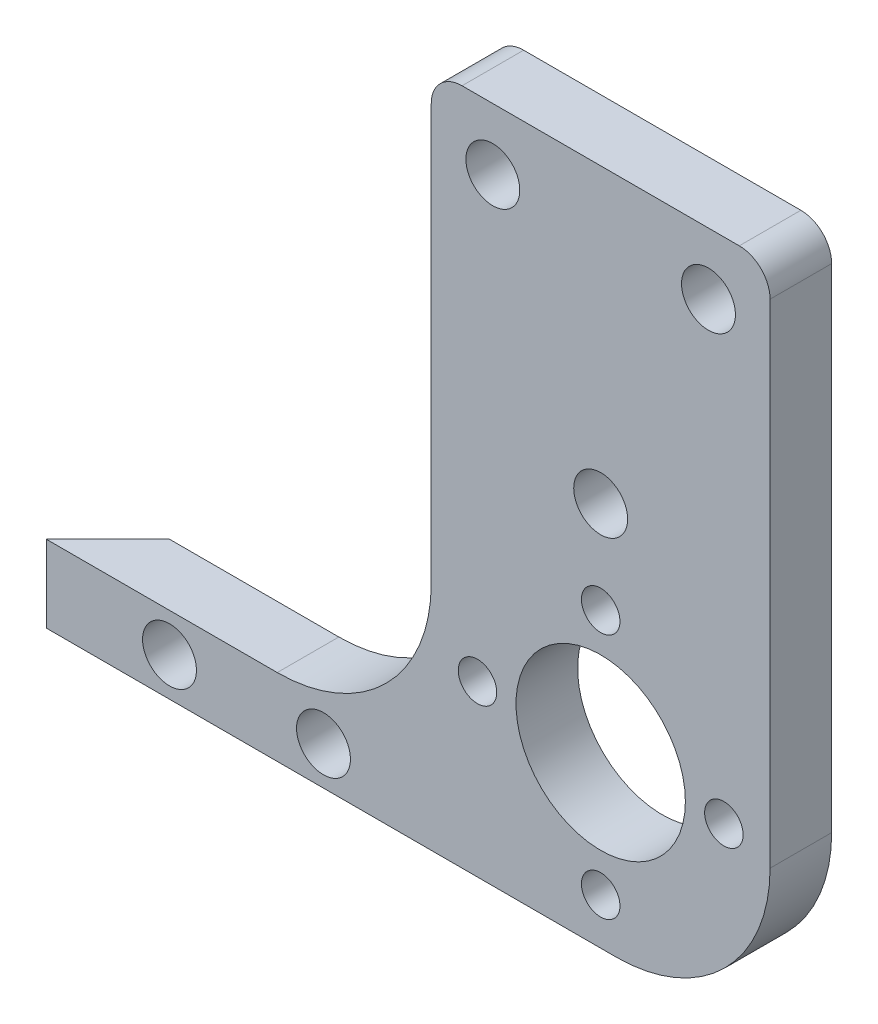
ISO-10303-21;
HEADER;
FILE_DESCRIPTION(('STEP AP214'),'2;1');
FILE_NAME('part.step','',(''),(''),'','','');
FILE_SCHEMA(('AUTOMOTIVE_DESIGN { 1 0 10303 214 1 1 1 1 }'));
ENDSEC;
DATA;
#1=APPLICATION_CONTEXT('core data for automotive mechanical design processes');
#2=APPLICATION_PROTOCOL_DEFINITION('international standard','automotive_design',2000,#1);
#3=PRODUCT_CONTEXT('',#1,'mechanical');
#4=PRODUCT('Part','Part','',(#3));
#5=PRODUCT_RELATED_PRODUCT_CATEGORY('part','',(#4));
#6=PRODUCT_DEFINITION_FORMATION('','',#4);
#7=PRODUCT_DEFINITION_CONTEXT('part definition',#1,'design');
#8=PRODUCT_DEFINITION('design','',#6,#7);
#9=PRODUCT_DEFINITION_SHAPE('','',#8);
#10=(LENGTH_UNIT() NAMED_UNIT(*) SI_UNIT(.MILLI.,.METRE.));
#11=(NAMED_UNIT(*) PLANE_ANGLE_UNIT() SI_UNIT($,.RADIAN.));
#12=(NAMED_UNIT(*) SI_UNIT($,.STERADIAN.) SOLID_ANGLE_UNIT());
#13=UNCERTAINTY_MEASURE_WITH_UNIT(LENGTH_MEASURE(1.E-05),#10,'distance_accuracy_value','');
#14=(GEOMETRIC_REPRESENTATION_CONTEXT(3) GLOBAL_UNCERTAINTY_ASSIGNED_CONTEXT((#13)) GLOBAL_UNIT_ASSIGNED_CONTEXT((#10,
#11,#12)) REPRESENTATION_CONTEXT('',''));
#15=CARTESIAN_POINT('',(0.,0.,0.));
#16=DIRECTION('',(0.,0.,1.));
#17=DIRECTION('',(1.,0.,0.));
#18=AXIS2_PLACEMENT_3D('',#15,#16,#17);
#19=CARTESIAN_POINT('',(0.,0.,0.));
#20=DIRECTION('',(0.,0.,1.));
#21=DIRECTION('',(1.,0.,0.));
#22=AXIS2_PLACEMENT_3D('',#19,#20,#21);
#23=PLANE('',#22);
#24=DIRECTION('',(0.,1.,0.));
#25=VECTOR('',#24,1.);
#26=CARTESIAN_POINT('',(46.7744145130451,-20.5411498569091,0.));
#27=LINE('',#26,#25);
#28=CARTESIAN_POINT('',(46.7744145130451,-25.5411498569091,0.));
#29=VERTEX_POINT('',#28);
#30=CARTESIAN_POINT('',(46.7744145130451,-20.5411498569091,0.));
#31=VERTEX_POINT('',#30);
#32=EDGE_CURVE('E131',#29,#31,#27,.T.);
#33=ORIENTED_EDGE('',*,*,#32,.T.);
#34=DIRECTION('',(1.,0.,0.));
#35=VECTOR('',#34,1.);
#36=CARTESIAN_POINT('',(67.7703147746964,-20.5411498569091,0.));
#37=LINE('',#36,#35);
#38=CARTESIAN_POINT('',(57.7703147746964,-20.5411498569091,0.));
#39=VERTEX_POINT('',#38);
#40=EDGE_CURVE('E133',#31,#39,#37,.T.);
#41=ORIENTED_EDGE('',*,*,#40,.T.);
#42=CARTESIAN_POINT('',(57.7703147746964,-10.5411498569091,0.));
#43=DIRECTION('',(0.,0.,1.));
#44=DIRECTION('',(1.,0.,0.));
#45=AXIS2_PLACEMENT_3D('',#42,#43,#44);
#46=CIRCLE('',#45,9.99999999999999);
#47=CARTESIAN_POINT('',(67.7703147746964,-10.5411498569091,0.));
#48=VERTEX_POINT('',#47);
#49=EDGE_CURVE('E95',#39,#48,#46,.T.);
#50=ORIENTED_EDGE('',*,*,#49,.T.);
#51=DIRECTION('',(0.,1.,0.));
#52=VECTOR('',#51,1.);
#53=CARTESIAN_POINT('',(67.7703147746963,18.4588501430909,0.));
#54=LINE('',#53,#52);
#55=CARTESIAN_POINT('',(67.7703147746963,16.4588501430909,0.));
#56=VERTEX_POINT('',#55);
#57=EDGE_CURVE('E88',#48,#56,#54,.T.);
#58=ORIENTED_EDGE('',*,*,#57,.T.);
#59=CARTESIAN_POINT('',(69.7703147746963,16.4588501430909,0.));
#60=DIRECTION('',(0.,0.,-1.));
#61=DIRECTION('',(-1.,0.,0.));
#62=AXIS2_PLACEMENT_3D('',#59,#60,#61);
#63=CIRCLE('',#62,2.);
#64=CARTESIAN_POINT('',(69.7703147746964,18.4588501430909,0.));
#65=VERTEX_POINT('',#64);
#66=EDGE_CURVE('E92',#65,#56,#63,.F.);
#67=ORIENTED_EDGE('',*,*,#66,.F.);
#68=DIRECTION('',(1.,0.,0.));
#69=VECTOR('',#68,1.);
#70=CARTESIAN_POINT('',(89.7744145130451,18.4588501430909,0.));
#71=LINE('',#70,#69);
#72=CARTESIAN_POINT('',(87.7744145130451,18.4588501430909,0.));
#73=VERTEX_POINT('',#72);
#74=EDGE_CURVE('E83',#65,#73,#71,.T.);
#75=ORIENTED_EDGE('',*,*,#74,.T.);
#76=CARTESIAN_POINT('',(87.7744145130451,16.4588501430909,0.));
#77=DIRECTION('',(0.,0.,-1.));
#78=DIRECTION('',(-1.,0.,0.));
#79=AXIS2_PLACEMENT_3D('',#76,#77,#78);
#80=CIRCLE('',#79,2.);
#81=CARTESIAN_POINT('',(89.7744145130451,16.4588501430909,0.));
#82=VERTEX_POINT('',#81);
#83=EDGE_CURVE('E182',#82,#73,#80,.F.);
#84=ORIENTED_EDGE('',*,*,#83,.F.);
#85=DIRECTION('',(0.,1.,0.));
#86=VECTOR('',#85,1.);
#87=CARTESIAN_POINT('',(89.7744145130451,-25.5411498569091,0.));
#88=LINE('',#87,#86);
#89=CARTESIAN_POINT('',(89.7744145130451,-15.5411498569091,0.));
#90=VERTEX_POINT('',#89);
#91=EDGE_CURVE('E120',#82,#90,#88,.F.);
#92=ORIENTED_EDGE('',*,*,#91,.T.);
#93=CARTESIAN_POINT('',(79.7744145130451,-15.5411498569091,0.));
#94=DIRECTION('',(0.,0.,-1.));
#95=DIRECTION('',(-1.,0.,0.));
#96=AXIS2_PLACEMENT_3D('',#93,#94,#95);
#97=CIRCLE('',#96,9.99999999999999);
#98=CARTESIAN_POINT('',(79.7744145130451,-25.5411498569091,0.));
#99=VERTEX_POINT('',#98);
#100=EDGE_CURVE('E185',#99,#90,#97,.F.);
#101=ORIENTED_EDGE('',*,*,#100,.F.);
#102=DIRECTION('',(1.,0.,0.));
#103=VECTOR('',#102,1.);
#104=CARTESIAN_POINT('',(42.7744145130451,-25.5411498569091,0.));
#105=LINE('',#104,#103);
#106=EDGE_CURVE('E124',#99,#29,#105,.F.);
#107=ORIENTED_EDGE('',*,*,#106,.T.);
#108=EDGE_LOOP('',(#33,#41,#50,#58,#67,#75,#84,#92,#101,#107));
#109=FACE_BOUND('',#108,.T.);
#110=CARTESIAN_POINT('',(86.7744145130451,-14.5411498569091,0.));
#111=DIRECTION('',(0.,0.,1.));
#112=DIRECTION('',(1.,0.,0.));
#113=AXIS2_PLACEMENT_3D('',#110,#111,#112);
#114=CIRCLE('',#113,1.25);
#115=CARTESIAN_POINT('',(88.0244145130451,-14.5411498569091,0.));
#116=VERTEX_POINT('',#115);
#117=EDGE_CURVE('E119',#116,#116,#114,.T.);
#118=ORIENTED_EDGE('',*,*,#117,.T.);
#119=EDGE_LOOP('',(#118));
#120=FACE_BOUND('',#119,.T.);
#121=CARTESIAN_POINT('',(78.7744145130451,-14.5411498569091,0.));
#122=DIRECTION('',(0.,0.,1.));
#123=DIRECTION('',(1.,0.,0.));
#124=AXIS2_PLACEMENT_3D('',#121,#122,#123);
#125=CIRCLE('',#124,5.50000000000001);
#126=CARTESIAN_POINT('',(84.2744145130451,-14.5411498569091,0.));
#127=VERTEX_POINT('',#126);
#128=EDGE_CURVE('E190',#127,#127,#125,.T.);
#129=ORIENTED_EDGE('',*,*,#128,.T.);
#130=EDGE_LOOP('',(#129));
#131=FACE_BOUND('',#130,.T.);
#132=CARTESIAN_POINT('',(70.7744145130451,-14.5411498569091,0.));
#133=DIRECTION('',(0.,0.,1.));
#134=DIRECTION('',(1.,0.,0.));
#135=AXIS2_PLACEMENT_3D('',#132,#133,#134);
#136=CIRCLE('',#135,1.25);
#137=CARTESIAN_POINT('',(72.0244145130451,-14.5411498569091,0.));
#138=VERTEX_POINT('',#137);
#139=EDGE_CURVE('E193',#138,#138,#136,.T.);
#140=ORIENTED_EDGE('',*,*,#139,.T.);
#141=EDGE_LOOP('',(#140));
#142=FACE_BOUND('',#141,.T.);
#143=CARTESIAN_POINT('',(78.774414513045,-6.54114985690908,0.));
#144=DIRECTION('',(0.,0.,1.));
#145=DIRECTION('',(1.,0.,0.));
#146=AXIS2_PLACEMENT_3D('',#143,#144,#145);
#147=CIRCLE('',#146,1.25);
#148=CARTESIAN_POINT('',(80.0244145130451,-6.54114985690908,0.));
#149=VERTEX_POINT('',#148);
#150=EDGE_CURVE('E196',#149,#149,#147,.T.);
#151=ORIENTED_EDGE('',*,*,#150,.T.);
#152=EDGE_LOOP('',(#151));
#153=FACE_BOUND('',#152,.T.);
#154=CARTESIAN_POINT('',(78.7744145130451,-22.5411498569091,0.));
#155=DIRECTION('',(0.,0.,1.));
#156=DIRECTION('',(1.,0.,0.));
#157=AXIS2_PLACEMENT_3D('',#154,#155,#156);
#158=CIRCLE('',#157,1.25);
#159=CARTESIAN_POINT('',(80.0244145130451,-22.5411498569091,0.));
#160=VERTEX_POINT('',#159);
#161=EDGE_CURVE('E199',#160,#160,#158,.T.);
#162=ORIENTED_EDGE('',*,*,#161,.T.);
#163=EDGE_LOOP('',(#162));
#164=FACE_BOUND('',#163,.T.);
#165=CARTESIAN_POINT('',(71.7703147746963,14.4588501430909,0.));
#166=DIRECTION('',(0.,0.,-1.));
#167=DIRECTION('',(-1.,0.,0.));
#168=AXIS2_PLACEMENT_3D('',#165,#166,#167);
#169=CIRCLE('',#168,1.75);
#170=CARTESIAN_POINT('',(70.0203147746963,14.4588501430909,0.));
#171=VERTEX_POINT('',#170);
#172=EDGE_CURVE('E202',#171,#171,#169,.F.);
#173=ORIENTED_EDGE('',*,*,#172,.T.);
#174=EDGE_LOOP('',(#173));
#175=FACE_BOUND('',#174,.T.);
#176=CARTESIAN_POINT('',(60.7744145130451,-23.0411498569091,0.));
#177=DIRECTION('',(0.,0.,-1.));
#178=DIRECTION('',(-1.,0.,0.));
#179=AXIS2_PLACEMENT_3D('',#176,#177,#178);
#180=CIRCLE('',#179,1.75);
#181=CARTESIAN_POINT('',(59.0244145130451,-23.0411498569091,0.));
#182=VERTEX_POINT('',#181);
#183=EDGE_CURVE('E205',#182,#182,#180,.F.);
#184=ORIENTED_EDGE('',*,*,#183,.T.);
#185=EDGE_LOOP('',(#184));
#186=FACE_BOUND('',#185,.T.);
#187=CARTESIAN_POINT('',(78.7723646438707,-0.541149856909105,0.));
#188=DIRECTION('',(0.,0.,-1.));
#189=DIRECTION('',(-1.,0.,0.));
#190=AXIS2_PLACEMENT_3D('',#187,#188,#189);
#191=CIRCLE('',#190,1.75);
#192=CARTESIAN_POINT('',(77.0223646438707,-0.541149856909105,0.));
#193=VERTEX_POINT('',#192);
#194=EDGE_CURVE('E208',#193,#193,#191,.F.);
#195=ORIENTED_EDGE('',*,*,#194,.T.);
#196=EDGE_LOOP('',(#195));
#197=FACE_BOUND('',#196,.T.);
#198=CARTESIAN_POINT('',(50.7744145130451,-23.0411498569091,0.));
#199=DIRECTION('',(0.,0.,-1.));
#200=DIRECTION('',(-1.,0.,0.));
#201=AXIS2_PLACEMENT_3D('',#198,#199,#200);
#202=CIRCLE('',#201,1.75);
#203=CARTESIAN_POINT('',(49.0244145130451,-23.0411498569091,0.));
#204=VERTEX_POINT('',#203);
#205=EDGE_CURVE('E210',#204,#204,#202,.F.);
#206=ORIENTED_EDGE('',*,*,#205,.T.);
#207=EDGE_LOOP('',(#206));
#208=FACE_BOUND('',#207,.T.);
#209=CARTESIAN_POINT('',(85.7744145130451,14.4588501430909,0.));
#210=DIRECTION('',(0.,0.,-1.));
#211=DIRECTION('',(-1.,0.,0.));
#212=AXIS2_PLACEMENT_3D('',#209,#210,#211);
#213=CIRCLE('',#212,1.75);
#214=CARTESIAN_POINT('',(84.0244145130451,14.4588501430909,0.));
#215=VERTEX_POINT('',#214);
#216=EDGE_CURVE('E19',#215,#215,#213,.F.);
#217=ORIENTED_EDGE('',*,*,#216,.T.);
#218=EDGE_LOOP('',(#217));
#219=FACE_BOUND('',#218,.T.);
#220=ADVANCED_FACE('F16',(#109,#120,#131,#142,#153,#164,#175,#186,#197,#208,#219),#23,.F.);
#221=CARTESIAN_POINT('',(85.7744145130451,14.4588501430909,5.));
#222=DIRECTION('',(0.,0.,-1.));
#223=DIRECTION('',(-1.,0.,0.));
#224=AXIS2_PLACEMENT_3D('',#221,#222,#223);
#225=CYLINDRICAL_SURFACE('',#224,1.75);
#226=CARTESIAN_POINT('',(85.7744145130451,14.4588501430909,4.));
#227=DIRECTION('',(0.,0.,-1.));
#228=DIRECTION('',(-1.,0.,0.));
#229=AXIS2_PLACEMENT_3D('',#226,#227,#228);
#230=CIRCLE('',#229,1.75);
#231=CARTESIAN_POINT('',(84.0244145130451,14.4588501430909,4.));
#232=VERTEX_POINT('',#231);
#233=EDGE_CURVE('E178',#232,#232,#230,.T.);
#234=ORIENTED_EDGE('',*,*,#233,.F.);
#235=EDGE_LOOP('',(#234));
#236=FACE_BOUND('',#235,.T.);
#237=ORIENTED_EDGE('',*,*,#216,.F.);
#238=EDGE_LOOP('',(#237));
#239=FACE_BOUND('',#238,.T.);
#240=ADVANCED_FACE('F218',(#236,#239),#225,.F.);
#241=CARTESIAN_POINT('',(50.7744145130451,-23.0411498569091,5.));
#242=DIRECTION('',(0.,0.,-1.));
#243=DIRECTION('',(-1.,0.,0.));
#244=AXIS2_PLACEMENT_3D('',#241,#242,#243);
#245=CYLINDRICAL_SURFACE('',#244,1.75);
#246=CARTESIAN_POINT('',(50.7744145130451,-23.0411498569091,4.));
#247=DIRECTION('',(0.,0.,-1.));
#248=DIRECTION('',(-1.,0.,0.));
#249=AXIS2_PLACEMENT_3D('',#246,#247,#248);
#250=CIRCLE('',#249,1.75);
#251=CARTESIAN_POINT('',(49.0244145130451,-23.0411498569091,4.));
#252=VERTEX_POINT('',#251);
#253=EDGE_CURVE('E175',#252,#252,#250,.T.);
#254=ORIENTED_EDGE('',*,*,#253,.F.);
#255=EDGE_LOOP('',(#254));
#256=FACE_BOUND('',#255,.T.);
#257=ORIENTED_EDGE('',*,*,#205,.F.);
#258=EDGE_LOOP('',(#257));
#259=FACE_BOUND('',#258,.T.);
#260=ADVANCED_FACE('F220',(#256,#259),#245,.F.);
#261=CARTESIAN_POINT('',(78.7723646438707,-0.541149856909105,5.));
#262=DIRECTION('',(0.,0.,-1.));
#263=DIRECTION('',(-1.,0.,0.));
#264=AXIS2_PLACEMENT_3D('',#261,#262,#263);
#265=CYLINDRICAL_SURFACE('',#264,1.75);
#266=CARTESIAN_POINT('',(78.7723646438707,-0.541149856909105,4.));
#267=DIRECTION('',(0.,0.,-1.));
#268=DIRECTION('',(-1.,0.,0.));
#269=AXIS2_PLACEMENT_3D('',#266,#267,#268);
#270=CIRCLE('',#269,1.75);
#271=CARTESIAN_POINT('',(77.0223646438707,-0.541149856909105,4.));
#272=VERTEX_POINT('',#271);
#273=EDGE_CURVE('E172',#272,#272,#270,.T.);
#274=ORIENTED_EDGE('',*,*,#273,.F.);
#275=EDGE_LOOP('',(#274));
#276=FACE_BOUND('',#275,.T.);
#277=ORIENTED_EDGE('',*,*,#194,.F.);
#278=EDGE_LOOP('',(#277));
#279=FACE_BOUND('',#278,.T.);
#280=ADVANCED_FACE('F227',(#276,#279),#265,.F.);
#281=CARTESIAN_POINT('',(60.7744145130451,-23.0411498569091,5.));
#282=DIRECTION('',(0.,0.,-1.));
#283=DIRECTION('',(-1.,0.,0.));
#284=AXIS2_PLACEMENT_3D('',#281,#282,#283);
#285=CYLINDRICAL_SURFACE('',#284,1.75);
#286=CARTESIAN_POINT('',(60.7744145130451,-23.0411498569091,4.));
#287=DIRECTION('',(0.,0.,-1.));
#288=DIRECTION('',(-1.,0.,0.));
#289=AXIS2_PLACEMENT_3D('',#286,#287,#288);
#290=CIRCLE('',#289,1.75);
#291=CARTESIAN_POINT('',(59.0244145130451,-23.0411498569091,4.));
#292=VERTEX_POINT('',#291);
#293=EDGE_CURVE('E169',#292,#292,#290,.T.);
#294=ORIENTED_EDGE('',*,*,#293,.F.);
#295=EDGE_LOOP('',(#294));
#296=FACE_BOUND('',#295,.T.);
#297=ORIENTED_EDGE('',*,*,#183,.F.);
#298=EDGE_LOOP('',(#297));
#299=FACE_BOUND('',#298,.T.);
#300=ADVANCED_FACE('F297',(#296,#299),#285,.F.);
#301=CARTESIAN_POINT('',(71.7703147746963,14.4588501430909,5.));
#302=DIRECTION('',(0.,0.,-1.));
#303=DIRECTION('',(-1.,0.,0.));
#304=AXIS2_PLACEMENT_3D('',#301,#302,#303);
#305=CYLINDRICAL_SURFACE('',#304,1.75);
#306=CARTESIAN_POINT('',(71.7703147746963,14.4588501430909,4.));
#307=DIRECTION('',(0.,0.,-1.));
#308=DIRECTION('',(-1.,0.,0.));
#309=AXIS2_PLACEMENT_3D('',#306,#307,#308);
#310=CIRCLE('',#309,1.75);
#311=CARTESIAN_POINT('',(70.0203147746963,14.4588501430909,4.));
#312=VERTEX_POINT('',#311);
#313=EDGE_CURVE('E166',#312,#312,#310,.T.);
#314=ORIENTED_EDGE('',*,*,#313,.F.);
#315=EDGE_LOOP('',(#314));
#316=FACE_BOUND('',#315,.T.);
#317=ORIENTED_EDGE('',*,*,#172,.F.);
#318=EDGE_LOOP('',(#317));
#319=FACE_BOUND('',#318,.T.);
#320=ADVANCED_FACE('F293',(#316,#319),#305,.F.);
#321=CARTESIAN_POINT('',(78.7744145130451,-22.5411498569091,-6.));
#322=DIRECTION('',(0.,0.,1.));
#323=DIRECTION('',(1.,0.,0.));
#324=AXIS2_PLACEMENT_3D('',#321,#322,#323);
#325=CYLINDRICAL_SURFACE('',#324,1.25);
#326=CARTESIAN_POINT('',(78.7744145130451,-22.5411498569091,4.));
#327=DIRECTION('',(0.,0.,1.));
#328=DIRECTION('',(1.,0.,0.));
#329=AXIS2_PLACEMENT_3D('',#326,#327,#328);
#330=CIRCLE('',#329,1.25);
#331=CARTESIAN_POINT('',(80.0244145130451,-22.5411498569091,4.));
#332=VERTEX_POINT('',#331);
#333=EDGE_CURVE('E163',#332,#332,#330,.F.);
#334=ORIENTED_EDGE('',*,*,#333,.F.);
#335=EDGE_LOOP('',(#334));
#336=FACE_BOUND('',#335,.T.);
#337=ORIENTED_EDGE('',*,*,#161,.F.);
#338=EDGE_LOOP('',(#337));
#339=FACE_BOUND('',#338,.T.);
#340=ADVANCED_FACE('F289',(#336,#339),#325,.F.);
#341=CARTESIAN_POINT('',(78.774414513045,-6.54114985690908,-6.));
#342=DIRECTION('',(0.,0.,1.));
#343=DIRECTION('',(1.,0.,0.));
#344=AXIS2_PLACEMENT_3D('',#341,#342,#343);
#345=CYLINDRICAL_SURFACE('',#344,1.25);
#346=CARTESIAN_POINT('',(78.774414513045,-6.54114985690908,4.));
#347=DIRECTION('',(0.,0.,1.));
#348=DIRECTION('',(1.,0.,0.));
#349=AXIS2_PLACEMENT_3D('',#346,#347,#348);
#350=CIRCLE('',#349,1.25);
#351=CARTESIAN_POINT('',(80.0244145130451,-6.54114985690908,4.));
#352=VERTEX_POINT('',#351);
#353=EDGE_CURVE('E160',#352,#352,#350,.F.);
#354=ORIENTED_EDGE('',*,*,#353,.F.);
#355=EDGE_LOOP('',(#354));
#356=FACE_BOUND('',#355,.T.);
#357=ORIENTED_EDGE('',*,*,#150,.F.);
#358=EDGE_LOOP('',(#357));
#359=FACE_BOUND('',#358,.T.);
#360=ADVANCED_FACE('F285',(#356,#359),#345,.F.);
#361=CARTESIAN_POINT('',(70.7744145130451,-14.5411498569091,-6.));
#362=DIRECTION('',(0.,0.,1.));
#363=DIRECTION('',(1.,0.,0.));
#364=AXIS2_PLACEMENT_3D('',#361,#362,#363);
#365=CYLINDRICAL_SURFACE('',#364,1.25);
#366=CARTESIAN_POINT('',(70.7744145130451,-14.5411498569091,4.));
#367=DIRECTION('',(0.,0.,1.));
#368=DIRECTION('',(1.,0.,0.));
#369=AXIS2_PLACEMENT_3D('',#366,#367,#368);
#370=CIRCLE('',#369,1.25);
#371=CARTESIAN_POINT('',(72.0244145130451,-14.5411498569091,4.));
#372=VERTEX_POINT('',#371);
#373=EDGE_CURVE('E157',#372,#372,#370,.F.);
#374=ORIENTED_EDGE('',*,*,#373,.F.);
#375=EDGE_LOOP('',(#374));
#376=FACE_BOUND('',#375,.T.);
#377=ORIENTED_EDGE('',*,*,#139,.F.);
#378=EDGE_LOOP('',(#377));
#379=FACE_BOUND('',#378,.T.);
#380=ADVANCED_FACE('F281',(#376,#379),#365,.F.);
#381=CARTESIAN_POINT('',(78.7744145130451,-14.5411498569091,-6.));
#382=DIRECTION('',(0.,0.,1.));
#383=DIRECTION('',(1.,0.,0.));
#384=AXIS2_PLACEMENT_3D('',#381,#382,#383);
#385=CYLINDRICAL_SURFACE('',#384,5.50000000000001);
#386=CARTESIAN_POINT('',(78.7744145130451,-14.5411498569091,4.));
#387=DIRECTION('',(0.,0.,1.));
#388=DIRECTION('',(1.,0.,0.));
#389=AXIS2_PLACEMENT_3D('',#386,#387,#388);
#390=CIRCLE('',#389,5.50000000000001);
#391=CARTESIAN_POINT('',(84.2744145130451,-14.5411498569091,4.));
#392=VERTEX_POINT('',#391);
#393=EDGE_CURVE('E154',#392,#392,#390,.F.);
#394=ORIENTED_EDGE('',*,*,#393,.F.);
#395=EDGE_LOOP('',(#394));
#396=FACE_BOUND('',#395,.T.);
#397=ORIENTED_EDGE('',*,*,#128,.F.);
#398=EDGE_LOOP('',(#397));
#399=FACE_BOUND('',#398,.T.);
#400=ADVANCED_FACE('F277',(#396,#399),#385,.F.);
#401=CARTESIAN_POINT('',(86.7744145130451,-14.5411498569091,-6.));
#402=DIRECTION('',(0.,0.,1.));
#403=DIRECTION('',(1.,0.,0.));
#404=AXIS2_PLACEMENT_3D('',#401,#402,#403);
#405=CYLINDRICAL_SURFACE('',#404,1.25);
#406=CARTESIAN_POINT('',(86.7744145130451,-14.5411498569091,4.));
#407=DIRECTION('',(0.,0.,1.));
#408=DIRECTION('',(1.,0.,0.));
#409=AXIS2_PLACEMENT_3D('',#406,#407,#408);
#410=CIRCLE('',#409,1.25);
#411=CARTESIAN_POINT('',(88.0244145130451,-14.5411498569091,4.));
#412=VERTEX_POINT('',#411);
#413=EDGE_CURVE('E151',#412,#412,#410,.F.);
#414=ORIENTED_EDGE('',*,*,#413,.F.);
#415=EDGE_LOOP('',(#414));
#416=FACE_BOUND('',#415,.T.);
#417=ORIENTED_EDGE('',*,*,#117,.F.);
#418=EDGE_LOOP('',(#417));
#419=FACE_BOUND('',#418,.T.);
#420=ADVANCED_FACE('F274',(#416,#419),#405,.F.);
#421=CARTESIAN_POINT('',(89.7744145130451,18.4588501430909,4.));
#422=DIRECTION('',(0.,-1.,0.));
#423=DIRECTION('',(1.,0.,0.));
#424=AXIS2_PLACEMENT_3D('',#421,#422,#423);
#425=PLANE('',#424);
#426=DIRECTION('',(0.,0.,-1.));
#427=VECTOR('',#426,1.);
#428=CARTESIAN_POINT('',(69.7703147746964,18.4588501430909,4.));
#429=LINE('',#428,#427);
#430=CARTESIAN_POINT('',(69.7703147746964,18.4588501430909,4.));
#431=VERTEX_POINT('',#430);
#432=EDGE_CURVE('E105',#431,#65,#429,.T.);
#433=ORIENTED_EDGE('',*,*,#432,.F.);
#434=DIRECTION('',(1.,0.,0.));
#435=VECTOR('',#434,1.);
#436=CARTESIAN_POINT('',(0.,18.4588501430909,4.));
#437=LINE('',#436,#435);
#438=CARTESIAN_POINT('',(87.7744145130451,18.4588501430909,4.));
#439=VERTEX_POINT('',#438);
#440=EDGE_CURVE('E150',#439,#431,#437,.F.);
#441=ORIENTED_EDGE('',*,*,#440,.F.);
#442=DIRECTION('',(0.,0.,-1.));
#443=VECTOR('',#442,1.);
#444=CARTESIAN_POINT('',(87.7744145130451,18.4588501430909,4.));
#445=LINE('',#444,#443);
#446=EDGE_CURVE('E181',#73,#439,#445,.F.);
#447=ORIENTED_EDGE('',*,*,#446,.F.);
#448=ORIENTED_EDGE('',*,*,#74,.F.);
#449=EDGE_LOOP('',(#433,#441,#447,#448));
#450=FACE_BOUND('',#449,.T.);
#451=ADVANCED_FACE('F271',(#450),#425,.F.);
#452=CARTESIAN_POINT('',(69.7703147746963,16.4588501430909,4.));
#453=DIRECTION('',(0.,0.,-1.));
#454=DIRECTION('',(-1.,0.,0.));
#455=AXIS2_PLACEMENT_3D('',#452,#453,#454);
#456=CYLINDRICAL_SURFACE('',#455,2.);
#457=ORIENTED_EDGE('',*,*,#66,.T.);
#458=DIRECTION('',(0.,0.,1.));
#459=VECTOR('',#458,1.);
#460=CARTESIAN_POINT('',(67.7703147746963,16.4588501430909,4.));
#461=LINE('',#460,#459);
#462=CARTESIAN_POINT('',(67.7703147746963,16.4588501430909,4.));
#463=VERTEX_POINT('',#462);
#464=EDGE_CURVE('E99',#56,#463,#461,.T.);
#465=ORIENTED_EDGE('',*,*,#464,.T.);
#466=CARTESIAN_POINT('',(69.7703147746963,16.4588501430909,4.));
#467=DIRECTION('',(0.,0.,-1.));
#468=DIRECTION('',(-1.,0.,0.));
#469=AXIS2_PLACEMENT_3D('',#466,#467,#468);
#470=CIRCLE('',#469,2.);
#471=EDGE_CURVE('E148',#431,#463,#470,.F.);
#472=ORIENTED_EDGE('',*,*,#471,.F.);
#473=ORIENTED_EDGE('',*,*,#432,.T.);
#474=EDGE_LOOP('',(#457,#465,#472,#473));
#475=FACE_BOUND('',#474,.T.);
#476=ADVANCED_FACE('F102',(#475),#456,.T.);
#477=CARTESIAN_POINT('',(67.7703147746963,18.4588501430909,4.));
#478=DIRECTION('',(1.,0.,0.));
#479=DIRECTION('',(0.,1.,0.));
#480=AXIS2_PLACEMENT_3D('',#477,#478,#479);
#481=PLANE('',#480);
#482=ORIENTED_EDGE('',*,*,#464,.F.);
#483=ORIENTED_EDGE('',*,*,#57,.F.);
#484=DIRECTION('',(0.,0.,1.));
#485=VECTOR('',#484,1.);
#486=CARTESIAN_POINT('',(67.7703147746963,-10.5411498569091,4.));
#487=LINE('',#486,#485);
#488=CARTESIAN_POINT('',(67.7703147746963,-10.5411498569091,4.));
#489=VERTEX_POINT('',#488);
#490=EDGE_CURVE('E112',#48,#489,#487,.T.);
#491=ORIENTED_EDGE('',*,*,#490,.T.);
#492=DIRECTION('',(0.,1.,0.));
#493=VECTOR('',#492,1.);
#494=CARTESIAN_POINT('',(67.7703147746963,0.,4.));
#495=LINE('',#494,#493);
#496=EDGE_CURVE('E109',#463,#489,#495,.F.);
#497=ORIENTED_EDGE('',*,*,#496,.F.);
#498=EDGE_LOOP('',(#482,#483,#491,#497));
#499=FACE_BOUND('',#498,.T.);
#500=ADVANCED_FACE('F107',(#499),#481,.F.);
#501=CARTESIAN_POINT('',(57.7703147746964,-10.5411498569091,4.));
#502=DIRECTION('',(0.,0.,1.));
#503=DIRECTION('',(1.,0.,0.));
#504=AXIS2_PLACEMENT_3D('',#501,#502,#503);
#505=CYLINDRICAL_SURFACE('',#504,9.99999999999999);
#506=ORIENTED_EDGE('',*,*,#490,.F.);
#507=ORIENTED_EDGE('',*,*,#49,.F.);
#508=DIRECTION('',(0.,0.,1.));
#509=VECTOR('',#508,1.);
#510=CARTESIAN_POINT('',(57.7703147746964,-20.5411498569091,4.));
#511=LINE('',#510,#509);
#512=CARTESIAN_POINT('',(57.7703147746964,-20.5411498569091,4.));
#513=VERTEX_POINT('',#512);
#514=EDGE_CURVE('E137',#39,#513,#511,.T.);
#515=ORIENTED_EDGE('',*,*,#514,.T.);
#516=CARTESIAN_POINT('',(57.7703147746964,-10.5411498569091,4.));
#517=DIRECTION('',(0.,0.,1.));
#518=DIRECTION('',(1.,0.,0.));
#519=AXIS2_PLACEMENT_3D('',#516,#517,#518);
#520=CIRCLE('',#519,9.99999999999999);
#521=EDGE_CURVE('E144',#489,#513,#520,.F.);
#522=ORIENTED_EDGE('',*,*,#521,.F.);
#523=EDGE_LOOP('',(#506,#507,#515,#522));
#524=FACE_BOUND('',#523,.T.);
#525=ADVANCED_FACE('F262',(#524),#505,.F.);
#526=CARTESIAN_POINT('',(67.7703147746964,-20.5411498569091,4.));
#527=DIRECTION('',(0.,-1.,0.));
#528=DIRECTION('',(1.,0.,0.));
#529=AXIS2_PLACEMENT_3D('',#526,#527,#528);
#530=PLANE('',#529);
#531=DIRECTION('',(0.707106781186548,0.,-0.707106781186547));
#532=VECTOR('',#531,1.);
#533=CARTESIAN_POINT('',(42.7744145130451,-20.5411498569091,4.));
#534=LINE('',#533,#532);
#535=CARTESIAN_POINT('',(42.7744145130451,-20.5411498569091,4.));
#536=VERTEX_POINT('',#535);
#537=EDGE_CURVE('E128',#31,#536,#534,.F.);
#538=ORIENTED_EDGE('',*,*,#537,.T.);
#539=DIRECTION('',(1.,0.,0.));
#540=VECTOR('',#539,1.);
#541=CARTESIAN_POINT('',(0.,-20.5411498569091,4.));
#542=LINE('',#541,#540);
#543=EDGE_CURVE('E147',#513,#536,#542,.F.);
#544=ORIENTED_EDGE('',*,*,#543,.F.);
#545=ORIENTED_EDGE('',*,*,#514,.F.);
#546=ORIENTED_EDGE('',*,*,#40,.F.);
#547=EDGE_LOOP('',(#538,#544,#545,#546));
#548=FACE_BOUND('',#547,.T.);
#549=ADVANCED_FACE('F258',(#548),#530,.F.);
#550=CARTESIAN_POINT('',(42.7744145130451,-20.5411498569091,4.));
#551=DIRECTION('',(0.707106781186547,0.,0.707106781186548));
#552=DIRECTION('',(0.707106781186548,0.,-0.707106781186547));
#553=AXIS2_PLACEMENT_3D('',#550,#551,#552);
#554=PLANE('',#553);
#555=ORIENTED_EDGE('',*,*,#32,.F.);
#556=DIRECTION('',(-0.707106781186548,0.,0.707106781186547));
#557=VECTOR('',#556,1.);
#558=CARTESIAN_POINT('',(46.7744145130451,-25.5411498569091,0.));
#559=LINE('',#558,#557);
#560=CARTESIAN_POINT('',(42.7744145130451,-25.5411498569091,4.));
#561=VERTEX_POINT('',#560);
#562=EDGE_CURVE('E127',#29,#561,#559,.T.);
#563=ORIENTED_EDGE('',*,*,#562,.T.);
#564=DIRECTION('',(0.,1.,0.));
#565=VECTOR('',#564,1.);
#566=CARTESIAN_POINT('',(42.7744145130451,0.,4.));
#567=LINE('',#566,#565);
#568=EDGE_CURVE('E496',#536,#561,#567,.F.);
#569=ORIENTED_EDGE('',*,*,#568,.F.);
#570=ORIENTED_EDGE('',*,*,#537,.F.);
#571=EDGE_LOOP('',(#555,#563,#569,#570));
#572=FACE_BOUND('',#571,.T.);
#573=ADVANCED_FACE('F254',(#572),#554,.F.);
#574=CARTESIAN_POINT('',(42.7744145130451,-25.5411498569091,4.));
#575=DIRECTION('',(0.,1.,0.));
#576=DIRECTION('',(0.,0.,1.));
#577=AXIS2_PLACEMENT_3D('',#574,#575,#576);
#578=PLANE('',#577);
#579=ORIENTED_EDGE('',*,*,#562,.F.);
#580=ORIENTED_EDGE('',*,*,#106,.F.);
#581=DIRECTION('',(0.,0.,-1.));
#582=VECTOR('',#581,1.);
#583=CARTESIAN_POINT('',(79.7744145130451,-25.5411498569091,4.));
#584=LINE('',#583,#582);
#585=CARTESIAN_POINT('',(79.7744145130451,-25.5411498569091,4.));
#586=VERTEX_POINT('',#585);
#587=EDGE_CURVE('E186',#586,#99,#584,.T.);
#588=ORIENTED_EDGE('',*,*,#587,.F.);
#589=DIRECTION('',(1.,0.,0.));
#590=VECTOR('',#589,1.);
#591=CARTESIAN_POINT('',(0.,-25.5411498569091,4.));
#592=LINE('',#591,#590);
#593=EDGE_CURVE('E143',#561,#586,#592,.T.);
#594=ORIENTED_EDGE('',*,*,#593,.F.);
#595=EDGE_LOOP('',(#579,#580,#588,#594));
#596=FACE_BOUND('',#595,.T.);
#597=ADVANCED_FACE('F250',(#596),#578,.F.);
#598=CARTESIAN_POINT('',(79.7744145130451,-15.5411498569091,4.));
#599=DIRECTION('',(0.,0.,-1.));
#600=DIRECTION('',(-1.,0.,0.));
#601=AXIS2_PLACEMENT_3D('',#598,#599,#600);
#602=CYLINDRICAL_SURFACE('',#601,9.99999999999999);
#603=ORIENTED_EDGE('',*,*,#100,.T.);
#604=DIRECTION('',(0.,0.,1.));
#605=VECTOR('',#604,1.);
#606=CARTESIAN_POINT('',(89.7744145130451,-15.5411498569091,4.));
#607=LINE('',#606,#605);
#608=CARTESIAN_POINT('',(89.7744145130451,-15.5411498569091,4.));
#609=VERTEX_POINT('',#608);
#610=EDGE_CURVE('E123',#90,#609,#607,.T.);
#611=ORIENTED_EDGE('',*,*,#610,.T.);
#612=CARTESIAN_POINT('',(79.7744145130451,-15.5411498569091,4.));
#613=DIRECTION('',(0.,0.,-1.));
#614=DIRECTION('',(-1.,0.,0.));
#615=AXIS2_PLACEMENT_3D('',#612,#613,#614);
#616=CIRCLE('',#615,9.99999999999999);
#617=EDGE_CURVE('E140',#586,#609,#616,.F.);
#618=ORIENTED_EDGE('',*,*,#617,.F.);
#619=ORIENTED_EDGE('',*,*,#587,.T.);
#620=EDGE_LOOP('',(#603,#611,#618,#619));
#621=FACE_BOUND('',#620,.T.);
#622=ADVANCED_FACE('F247',(#621),#602,.T.);
#623=CARTESIAN_POINT('',(89.7744145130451,-25.5411498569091,4.));
#624=DIRECTION('',(-1.,0.,0.));
#625=DIRECTION('',(0.,0.,1.));
#626=AXIS2_PLACEMENT_3D('',#623,#624,#625);
#627=PLANE('',#626);
#628=DIRECTION('',(0.,0.,-1.));
#629=VECTOR('',#628,1.);
#630=CARTESIAN_POINT('',(89.7744145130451,16.4588501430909,4.));
#631=LINE('',#630,#629);
#632=CARTESIAN_POINT('',(89.7744145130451,16.4588501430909,4.));
#633=VERTEX_POINT('',#632);
#634=EDGE_CURVE('E34',#633,#82,#631,.T.);
#635=ORIENTED_EDGE('',*,*,#634,.F.);
#636=DIRECTION('',(0.,1.,0.));
#637=VECTOR('',#636,1.);
#638=CARTESIAN_POINT('',(89.7744145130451,0.,4.));
#639=LINE('',#638,#637);
#640=EDGE_CURVE('E25',#609,#633,#639,.T.);
#641=ORIENTED_EDGE('',*,*,#640,.F.);
#642=ORIENTED_EDGE('',*,*,#610,.F.);
#643=ORIENTED_EDGE('',*,*,#91,.F.);
#644=EDGE_LOOP('',(#635,#641,#642,#643));
#645=FACE_BOUND('',#644,.T.);
#646=ADVANCED_FACE('F239',(#645),#627,.F.);
#647=CARTESIAN_POINT('',(87.7744145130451,16.4588501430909,4.));
#648=DIRECTION('',(0.,0.,-1.));
#649=DIRECTION('',(-1.,0.,0.));
#650=AXIS2_PLACEMENT_3D('',#647,#648,#649);
#651=CYLINDRICAL_SURFACE('',#650,2.);
#652=ORIENTED_EDGE('',*,*,#83,.T.);
#653=ORIENTED_EDGE('',*,*,#446,.T.);
#654=CARTESIAN_POINT('',(87.7744145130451,16.4588501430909,4.));
#655=DIRECTION('',(0.,0.,-1.));
#656=DIRECTION('',(-1.,0.,0.));
#657=AXIS2_PLACEMENT_3D('',#654,#655,#656);
#658=CIRCLE('',#657,2.);
#659=EDGE_CURVE('E10',#633,#439,#658,.F.);
#660=ORIENTED_EDGE('',*,*,#659,.F.);
#661=ORIENTED_EDGE('',*,*,#634,.T.);
#662=EDGE_LOOP('',(#652,#653,#660,#661));
#663=FACE_BOUND('',#662,.T.);
#664=ADVANCED_FACE('F233',(#663),#651,.T.);
#665=CARTESIAN_POINT('',(0.,0.,4.));
#666=DIRECTION('',(0.,0.,1.));
#667=DIRECTION('',(1.,0.,0.));
#668=AXIS2_PLACEMENT_3D('',#665,#666,#667);
#669=PLANE('',#668);
#670=ORIENTED_EDGE('',*,*,#640,.T.);
#671=ORIENTED_EDGE('',*,*,#659,.T.);
#672=ORIENTED_EDGE('',*,*,#440,.T.);
#673=ORIENTED_EDGE('',*,*,#471,.T.);
#674=ORIENTED_EDGE('',*,*,#496,.T.);
#675=ORIENTED_EDGE('',*,*,#521,.T.);
#676=ORIENTED_EDGE('',*,*,#543,.T.);
#677=ORIENTED_EDGE('',*,*,#568,.T.);
#678=ORIENTED_EDGE('',*,*,#593,.T.);
#679=ORIENTED_EDGE('',*,*,#617,.T.);
#680=EDGE_LOOP('',(#670,#671,#672,#673,#674,#675,#676,#677,#678,#679));
#681=FACE_BOUND('',#680,.T.);
#682=ORIENTED_EDGE('',*,*,#413,.T.);
#683=EDGE_LOOP('',(#682));
#684=FACE_BOUND('',#683,.T.);
#685=ORIENTED_EDGE('',*,*,#393,.T.);
#686=EDGE_LOOP('',(#685));
#687=FACE_BOUND('',#686,.T.);
#688=ORIENTED_EDGE('',*,*,#373,.T.);
#689=EDGE_LOOP('',(#688));
#690=FACE_BOUND('',#689,.T.);
#691=ORIENTED_EDGE('',*,*,#353,.T.);
#692=EDGE_LOOP('',(#691));
#693=FACE_BOUND('',#692,.T.);
#694=ORIENTED_EDGE('',*,*,#333,.T.);
#695=EDGE_LOOP('',(#694));
#696=FACE_BOUND('',#695,.T.);
#697=ORIENTED_EDGE('',*,*,#313,.T.);
#698=EDGE_LOOP('',(#697));
#699=FACE_BOUND('',#698,.T.);
#700=ORIENTED_EDGE('',*,*,#293,.T.);
#701=EDGE_LOOP('',(#700));
#702=FACE_BOUND('',#701,.T.);
#703=ORIENTED_EDGE('',*,*,#273,.T.);
#704=EDGE_LOOP('',(#703));
#705=FACE_BOUND('',#704,.T.);
#706=ORIENTED_EDGE('',*,*,#253,.T.);
#707=EDGE_LOOP('',(#706));
#708=FACE_BOUND('',#707,.T.);
#709=ORIENTED_EDGE('',*,*,#233,.T.);
#710=EDGE_LOOP('',(#709));
#711=FACE_BOUND('',#710,.T.);
#712=ADVANCED_FACE('F231',(#681,#684,#687,#690,#693,#696,#699,#702,#705,#708,#711),#669,.T.);
#713=CLOSED_SHELL('',(#220,#240,#260,#280,#300,#320,#340,#360,#380,#400,#420,#451,#476,#500,
#525,#549,#573,#597,#622,#646,#664,#712));
#714=MANIFOLD_SOLID_BREP('B1',#713);
#715=ADVANCED_BREP_SHAPE_REPRESENTATION('',(#18,#714),#14);
#716=SHAPE_DEFINITION_REPRESENTATION(#9,#715);
ENDSEC;
END-ISO-10303-21;
